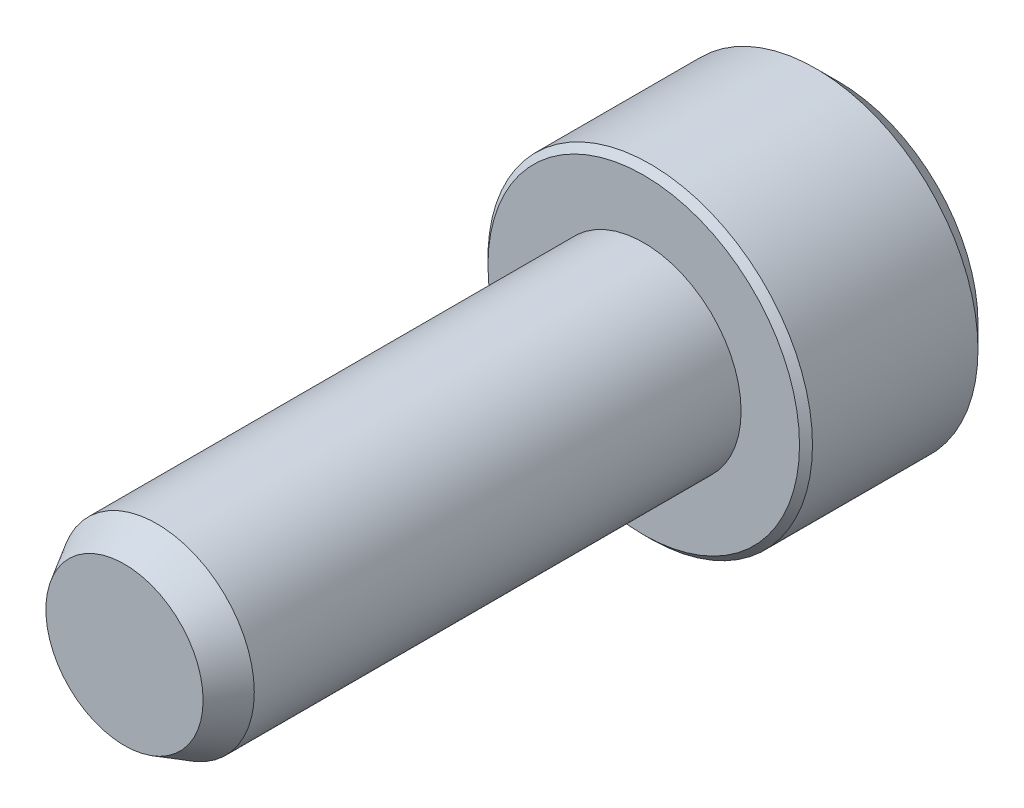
ISO-10303-21;
HEADER;
FILE_DESCRIPTION(('STEP AP214'),'2;1');
FILE_NAME('part.step','',(''),(''),'','','');
FILE_SCHEMA(('AUTOMOTIVE_DESIGN { 1 0 10303 214 1 1 1 1 }'));
ENDSEC;
DATA;
#1=APPLICATION_CONTEXT('core data for automotive mechanical design processes');
#2=APPLICATION_PROTOCOL_DEFINITION('international standard','automotive_design',2000,#1);
#3=PRODUCT_CONTEXT('',#1,'mechanical');
#4=PRODUCT('Part','Part','',(#3));
#5=PRODUCT_RELATED_PRODUCT_CATEGORY('part','',(#4));
#6=PRODUCT_DEFINITION_FORMATION('','',#4);
#7=PRODUCT_DEFINITION_CONTEXT('part definition',#1,'design');
#8=PRODUCT_DEFINITION('design','',#6,#7);
#9=PRODUCT_DEFINITION_SHAPE('','',#8);
#10=(LENGTH_UNIT() NAMED_UNIT(*) SI_UNIT(.MILLI.,.METRE.));
#11=(NAMED_UNIT(*) PLANE_ANGLE_UNIT() SI_UNIT($,.RADIAN.));
#12=(NAMED_UNIT(*) SI_UNIT($,.STERADIAN.) SOLID_ANGLE_UNIT());
#13=UNCERTAINTY_MEASURE_WITH_UNIT(LENGTH_MEASURE(1.E-05),#10,'distance_accuracy_value','');
#14=(GEOMETRIC_REPRESENTATION_CONTEXT(3) GLOBAL_UNCERTAINTY_ASSIGNED_CONTEXT((#13)) GLOBAL_UNIT_ASSIGNED_CONTEXT((#10,
#11,#12)) REPRESENTATION_CONTEXT('',''));
#15=CARTESIAN_POINT('',(0.,0.,0.));
#16=DIRECTION('',(0.,0.,1.));
#17=DIRECTION('',(1.,0.,0.));
#18=AXIS2_PLACEMENT_3D('',#15,#16,#17);
#19=CARTESIAN_POINT('',(0.,0.,-6.));
#20=DIRECTION('',(0.,0.,1.));
#21=DIRECTION('',(1.,0.,0.));
#22=AXIS2_PLACEMENT_3D('',#19,#20,#21);
#23=PLANE('',#22);
#24=CARTESIAN_POINT('',(0.,0.,-6.));
#25=DIRECTION('',(0.,0.,1.));
#26=DIRECTION('',(1.,0.,0.));
#27=AXIS2_PLACEMENT_3D('',#24,#25,#26);
#28=CIRCLE('',#27,4.3);
#29=CARTESIAN_POINT('',(4.3,0.,-6.));
#30=VERTEX_POINT('',#29);
#31=EDGE_CURVE('E140',#30,#30,#28,.F.);
#32=ORIENTED_EDGE('',*,*,#31,.T.);
#33=EDGE_LOOP('',(#32));
#34=FACE_BOUND('',#33,.T.);
#35=DIRECTION('',(-0.500000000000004,-0.866025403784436,0.));
#36=VECTOR('',#35,1.);
#37=CARTESIAN_POINT('',(-1.44337567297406,2.5,-6.));
#38=LINE('',#37,#36);
#39=CARTESIAN_POINT('',(-1.44337567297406,2.5,-6.));
#40=VERTEX_POINT('',#39);
#41=CARTESIAN_POINT('',(-2.88675134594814,0.,-6.));
#42=VERTEX_POINT('',#41);
#43=EDGE_CURVE('E47',#40,#42,#38,.T.);
#44=ORIENTED_EDGE('',*,*,#43,.T.);
#45=DIRECTION('',(0.500000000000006,-0.866025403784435,0.));
#46=VECTOR('',#45,1.);
#47=CARTESIAN_POINT('',(-2.88675134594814,0.,-6.));
#48=LINE('',#47,#46);
#49=CARTESIAN_POINT('',(-1.44337567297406,-2.5,-6.));
#50=VERTEX_POINT('',#49);
#51=EDGE_CURVE('E87',#42,#50,#48,.T.);
#52=ORIENTED_EDGE('',*,*,#51,.T.);
#53=DIRECTION('',(1.,0.,0.));
#54=VECTOR('',#53,1.);
#55=CARTESIAN_POINT('',(-1.44337567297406,-2.5,-6.));
#56=LINE('',#55,#54);
#57=CARTESIAN_POINT('',(1.44337567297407,-2.5,-6.));
#58=VERTEX_POINT('',#57);
#59=EDGE_CURVE('E95',#50,#58,#56,.T.);
#60=ORIENTED_EDGE('',*,*,#59,.T.);
#61=DIRECTION('',(0.500000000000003,0.866025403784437,0.));
#62=VECTOR('',#61,1.);
#63=CARTESIAN_POINT('',(1.44337567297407,-2.5,-6.));
#64=LINE('',#63,#62);
#65=CARTESIAN_POINT('',(2.88675134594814,0.,-6.));
#66=VERTEX_POINT('',#65);
#67=EDGE_CURVE('E110',#58,#66,#64,.T.);
#68=ORIENTED_EDGE('',*,*,#67,.T.);
#69=DIRECTION('',(-0.499999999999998,0.86602540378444,0.));
#70=VECTOR('',#69,1.);
#71=CARTESIAN_POINT('',(1.44337567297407,2.5,-6.));
#72=LINE('',#71,#70);
#73=CARTESIAN_POINT('',(1.44337567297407,2.5,-6.));
#74=VERTEX_POINT('',#73);
#75=EDGE_CURVE('E113',#66,#74,#72,.T.);
#76=ORIENTED_EDGE('',*,*,#75,.T.);
#77=DIRECTION('',(-1.,0.,0.));
#78=VECTOR('',#77,1.);
#79=CARTESIAN_POINT('',(-1.44337567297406,2.5,-6.));
#80=LINE('',#79,#78);
#81=EDGE_CURVE('E106',#74,#40,#80,.T.);
#82=ORIENTED_EDGE('',*,*,#81,.T.);
#83=EDGE_LOOP('',(#44,#52,#60,#68,#76,#82));
#84=FACE_BOUND('',#83,.T.);
#85=ADVANCED_FACE('F32',(#34,#84),#23,.F.);
#86=CARTESIAN_POINT('',(0.,0.,16.));
#87=DIRECTION('',(0.,0.,-1.));
#88=DIRECTION('',(-1.,0.,0.));
#89=AXIS2_PLACEMENT_3D('',#86,#87,#88);
#90=CYLINDRICAL_SURFACE('',#89,3.);
#91=CARTESIAN_POINT('',(0.,0.,15.));
#92=DIRECTION('',(0.,0.,1.));
#93=DIRECTION('',(1.,0.,0.));
#94=AXIS2_PLACEMENT_3D('',#91,#92,#93);
#95=CIRCLE('',#94,3.);
#96=CARTESIAN_POINT('',(3.,0.,15.));
#97=VERTEX_POINT('',#96);
#98=EDGE_CURVE('E146',#97,#97,#95,.F.);
#99=ORIENTED_EDGE('',*,*,#98,.T.);
#100=EDGE_LOOP('',(#99));
#101=FACE_BOUND('',#100,.T.);
#102=CARTESIAN_POINT('',(0.,0.,0.));
#103=DIRECTION('',(0.,0.,1.));
#104=DIRECTION('',(1.,0.,0.));
#105=AXIS2_PLACEMENT_3D('',#102,#103,#104);
#106=CIRCLE('',#105,3.);
#107=CARTESIAN_POINT('',(3.,0.,0.));
#108=VERTEX_POINT('',#107);
#109=EDGE_CURVE('E101',#108,#108,#106,.T.);
#110=ORIENTED_EDGE('',*,*,#109,.T.);
#111=EDGE_LOOP('',(#110));
#112=FACE_BOUND('',#111,.T.);
#113=ADVANCED_FACE('F34',(#101,#112),#90,.T.);
#114=CARTESIAN_POINT('',(0.,0.,16.));
#115=DIRECTION('',(0.,0.,1.));
#116=DIRECTION('',(1.,0.,0.));
#117=AXIS2_PLACEMENT_3D('',#114,#115,#116);
#118=PLANE('',#117);
#119=CARTESIAN_POINT('',(0.,0.,16.));
#120=DIRECTION('',(0.,0.,1.));
#121=DIRECTION('',(1.,0.,0.));
#122=AXIS2_PLACEMENT_3D('',#119,#120,#121);
#123=CIRCLE('',#122,2.42264973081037);
#124=CARTESIAN_POINT('',(2.42264973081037,0.,16.));
#125=VERTEX_POINT('',#124);
#126=EDGE_CURVE('E143',#125,#125,#123,.T.);
#127=ORIENTED_EDGE('',*,*,#126,.T.);
#128=EDGE_LOOP('',(#127));
#129=FACE_BOUND('',#128,.T.);
#130=ADVANCED_FACE('F172',(#129),#118,.T.);
#131=CARTESIAN_POINT('',(0.,0.,0.));
#132=DIRECTION('',(0.,0.,1.));
#133=DIRECTION('',(1.,0.,0.));
#134=AXIS2_PLACEMENT_3D('',#131,#132,#133);
#135=PLANE('',#134);
#136=CARTESIAN_POINT('',(0.,0.,0.));
#137=DIRECTION('',(0.,0.,1.));
#138=DIRECTION('',(1.,0.,0.));
#139=AXIS2_PLACEMENT_3D('',#136,#137,#138);
#140=CIRCLE('',#139,4.8);
#141=CARTESIAN_POINT('',(4.8,0.,0.));
#142=VERTEX_POINT('',#141);
#143=EDGE_CURVE('E40',#142,#142,#140,.T.);
#144=ORIENTED_EDGE('',*,*,#143,.T.);
#145=EDGE_LOOP('',(#144));
#146=FACE_BOUND('',#145,.T.);
#147=ORIENTED_EDGE('',*,*,#109,.F.);
#148=EDGE_LOOP('',(#147));
#149=FACE_BOUND('',#148,.T.);
#150=ADVANCED_FACE('F151',(#146,#149),#135,.T.);
#151=CARTESIAN_POINT('',(0.,0.,-6.));
#152=DIRECTION('',(0.,0.,1.));
#153=DIRECTION('',(1.,0.,0.));
#154=AXIS2_PLACEMENT_3D('',#151,#152,#153);
#155=CYLINDRICAL_SURFACE('',#154,5.);
#156=CARTESIAN_POINT('',(0.,0.,-0.200000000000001));
#157=DIRECTION('',(0.,0.,1.));
#158=DIRECTION('',(1.,0.,0.));
#159=AXIS2_PLACEMENT_3D('',#156,#157,#158);
#160=CIRCLE('',#159,5.);
#161=CARTESIAN_POINT('',(5.,0.,-0.200000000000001));
#162=VERTEX_POINT('',#161);
#163=EDGE_CURVE('E11',#162,#162,#160,.F.);
#164=ORIENTED_EDGE('',*,*,#163,.T.);
#165=EDGE_LOOP('',(#164));
#166=FACE_BOUND('',#165,.T.);
#167=CARTESIAN_POINT('',(0.,0.,-5.3));
#168=DIRECTION('',(0.,0.,1.));
#169=DIRECTION('',(1.,0.,0.));
#170=AXIS2_PLACEMENT_3D('',#167,#168,#169);
#171=CIRCLE('',#170,5.);
#172=CARTESIAN_POINT('',(5.,0.,-5.3));
#173=VERTEX_POINT('',#172);
#174=EDGE_CURVE('E137',#173,#173,#171,.T.);
#175=ORIENTED_EDGE('',*,*,#174,.T.);
#176=EDGE_LOOP('',(#175));
#177=FACE_BOUND('',#176,.T.);
#178=ADVANCED_FACE('F177',(#166,#177),#155,.T.);
#179=CARTESIAN_POINT('',(-1.44337567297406,2.5,-3.));
#180=DIRECTION('',(0.866025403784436,-0.500000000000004,0.));
#181=DIRECTION('',(0.500000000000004,0.866025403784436,0.));
#182=AXIS2_PLACEMENT_3D('',#179,#180,#181);
#183=PLANE('',#182);
#184=ORIENTED_EDGE('',*,*,#43,.F.);
#185=DIRECTION('',(0.,0.,-1.));
#186=VECTOR('',#185,1.);
#187=CARTESIAN_POINT('',(-1.44337567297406,2.5,-3.));
#188=LINE('',#187,#186);
#189=CARTESIAN_POINT('',(-1.44337567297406,2.5,-3.));
#190=VERTEX_POINT('',#189);
#191=EDGE_CURVE('E126',#190,#40,#188,.T.);
#192=ORIENTED_EDGE('',*,*,#191,.F.);
#193=DIRECTION('',(-0.500000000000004,-0.866025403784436,0.));
#194=VECTOR('',#193,1.);
#195=CARTESIAN_POINT('',(-1.44337567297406,2.5,-3.));
#196=LINE('',#195,#194);
#197=CARTESIAN_POINT('',(-2.88675134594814,0.,-3.));
#198=VERTEX_POINT('',#197);
#199=EDGE_CURVE('E100',#190,#198,#196,.T.);
#200=ORIENTED_EDGE('',*,*,#199,.T.);
#201=DIRECTION('',(0.,0.,-1.));
#202=VECTOR('',#201,1.);
#203=CARTESIAN_POINT('',(-2.88675134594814,0.,-3.));
#204=LINE('',#203,#202);
#205=EDGE_CURVE('E89',#198,#42,#204,.T.);
#206=ORIENTED_EDGE('',*,*,#205,.T.);
#207=EDGE_LOOP('',(#184,#192,#200,#206));
#208=FACE_BOUND('',#207,.T.);
#209=ADVANCED_FACE('F98',(#208),#183,.T.);
#210=CARTESIAN_POINT('',(-2.88675134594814,0.,-3.));
#211=DIRECTION('',(0.866025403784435,0.500000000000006,0.));
#212=DIRECTION('',(-0.500000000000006,0.866025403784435,0.));
#213=AXIS2_PLACEMENT_3D('',#210,#211,#212);
#214=PLANE('',#213);
#215=ORIENTED_EDGE('',*,*,#51,.F.);
#216=ORIENTED_EDGE('',*,*,#205,.F.);
#217=DIRECTION('',(0.500000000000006,-0.866025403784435,0.));
#218=VECTOR('',#217,1.);
#219=CARTESIAN_POINT('',(-2.88675134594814,0.,-3.));
#220=LINE('',#219,#218);
#221=CARTESIAN_POINT('',(-1.44337567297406,-2.5,-3.));
#222=VERTEX_POINT('',#221);
#223=EDGE_CURVE('E117',#198,#222,#220,.T.);
#224=ORIENTED_EDGE('',*,*,#223,.T.);
#225=DIRECTION('',(0.,0.,-1.));
#226=VECTOR('',#225,1.);
#227=CARTESIAN_POINT('',(-1.44337567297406,-2.5,-3.));
#228=LINE('',#227,#226);
#229=EDGE_CURVE('E91',#222,#50,#228,.T.);
#230=ORIENTED_EDGE('',*,*,#229,.T.);
#231=EDGE_LOOP('',(#215,#216,#224,#230));
#232=FACE_BOUND('',#231,.T.);
#233=ADVANCED_FACE('F88',(#232),#214,.T.);
#234=CARTESIAN_POINT('',(-1.44337567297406,-2.5,-3.));
#235=DIRECTION('',(0.,1.,0.));
#236=DIRECTION('',(0.,0.,1.));
#237=AXIS2_PLACEMENT_3D('',#234,#235,#236);
#238=PLANE('',#237);
#239=ORIENTED_EDGE('',*,*,#59,.F.);
#240=ORIENTED_EDGE('',*,*,#229,.F.);
#241=DIRECTION('',(1.,0.,0.));
#242=VECTOR('',#241,1.);
#243=CARTESIAN_POINT('',(-1.44337567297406,-2.5,-3.));
#244=LINE('',#243,#242);
#245=CARTESIAN_POINT('',(1.44337567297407,-2.5,-3.));
#246=VERTEX_POINT('',#245);
#247=EDGE_CURVE('E119',#222,#246,#244,.T.);
#248=ORIENTED_EDGE('',*,*,#247,.T.);
#249=DIRECTION('',(0.,0.,-1.));
#250=VECTOR('',#249,1.);
#251=CARTESIAN_POINT('',(1.44337567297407,-2.5,-3.));
#252=LINE('',#251,#250);
#253=EDGE_CURVE('E132',#246,#58,#252,.T.);
#254=ORIENTED_EDGE('',*,*,#253,.T.);
#255=EDGE_LOOP('',(#239,#240,#248,#254));
#256=FACE_BOUND('',#255,.T.);
#257=ADVANCED_FACE('F205',(#256),#238,.T.);
#258=CARTESIAN_POINT('',(1.44337567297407,-2.5,-3.));
#259=DIRECTION('',(-0.866025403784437,0.500000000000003,0.));
#260=DIRECTION('',(-0.500000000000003,-0.866025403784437,0.));
#261=AXIS2_PLACEMENT_3D('',#258,#259,#260);
#262=PLANE('',#261);
#263=ORIENTED_EDGE('',*,*,#67,.F.);
#264=ORIENTED_EDGE('',*,*,#253,.F.);
#265=DIRECTION('',(0.500000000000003,0.866025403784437,0.));
#266=VECTOR('',#265,1.);
#267=CARTESIAN_POINT('',(1.44337567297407,-2.5,-3.));
#268=LINE('',#267,#266);
#269=CARTESIAN_POINT('',(2.88675134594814,0.,-3.));
#270=VERTEX_POINT('',#269);
#271=EDGE_CURVE('E121',#246,#270,#268,.T.);
#272=ORIENTED_EDGE('',*,*,#271,.T.);
#273=DIRECTION('',(0.,0.,-1.));
#274=VECTOR('',#273,1.);
#275=CARTESIAN_POINT('',(2.88675134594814,0.,-3.));
#276=LINE('',#275,#274);
#277=EDGE_CURVE('E130',#270,#66,#276,.T.);
#278=ORIENTED_EDGE('',*,*,#277,.T.);
#279=EDGE_LOOP('',(#263,#264,#272,#278));
#280=FACE_BOUND('',#279,.T.);
#281=ADVANCED_FACE('F212',(#280),#262,.T.);
#282=CARTESIAN_POINT('',(1.44337567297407,2.5,-3.));
#283=DIRECTION('',(-0.86602540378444,-0.499999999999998,0.));
#284=DIRECTION('',(0.499999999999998,-0.86602540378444,0.));
#285=AXIS2_PLACEMENT_3D('',#282,#283,#284);
#286=PLANE('',#285);
#287=ORIENTED_EDGE('',*,*,#75,.F.);
#288=ORIENTED_EDGE('',*,*,#277,.F.);
#289=DIRECTION('',(-0.499999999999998,0.86602540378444,0.));
#290=VECTOR('',#289,1.);
#291=CARTESIAN_POINT('',(1.44337567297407,2.5,-3.));
#292=LINE('',#291,#290);
#293=CARTESIAN_POINT('',(1.44337567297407,2.5,-3.));
#294=VERTEX_POINT('',#293);
#295=EDGE_CURVE('E123',#270,#294,#292,.T.);
#296=ORIENTED_EDGE('',*,*,#295,.T.);
#297=DIRECTION('',(0.,0.,-1.));
#298=VECTOR('',#297,1.);
#299=CARTESIAN_POINT('',(1.44337567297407,2.5,-3.));
#300=LINE('',#299,#298);
#301=EDGE_CURVE('E128',#294,#74,#300,.T.);
#302=ORIENTED_EDGE('',*,*,#301,.T.);
#303=EDGE_LOOP('',(#287,#288,#296,#302));
#304=FACE_BOUND('',#303,.T.);
#305=ADVANCED_FACE('F220',(#304),#286,.T.);
#306=CARTESIAN_POINT('',(-1.44337567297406,2.5,-3.));
#307=DIRECTION('',(0.,-1.,0.));
#308=DIRECTION('',(0.,0.,-1.));
#309=AXIS2_PLACEMENT_3D('',#306,#307,#308);
#310=PLANE('',#309);
#311=ORIENTED_EDGE('',*,*,#81,.F.);
#312=ORIENTED_EDGE('',*,*,#301,.F.);
#313=DIRECTION('',(-1.,0.,0.));
#314=VECTOR('',#313,1.);
#315=CARTESIAN_POINT('',(-1.44337567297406,2.5,-3.));
#316=LINE('',#315,#314);
#317=EDGE_CURVE('E54',#294,#190,#316,.T.);
#318=ORIENTED_EDGE('',*,*,#317,.T.);
#319=ORIENTED_EDGE('',*,*,#191,.T.);
#320=EDGE_LOOP('',(#311,#312,#318,#319));
#321=FACE_BOUND('',#320,.T.);
#322=ADVANCED_FACE('F228',(#321),#310,.T.);
#323=CARTESIAN_POINT('',(-2.88675134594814,0.,-3.));
#324=DIRECTION('',(0.,0.,1.));
#325=DIRECTION('',(1.,0.,0.));
#326=AXIS2_PLACEMENT_3D('',#323,#324,#325);
#327=PLANE('',#326);
#328=ORIENTED_EDGE('',*,*,#199,.F.);
#329=ORIENTED_EDGE('',*,*,#317,.F.);
#330=ORIENTED_EDGE('',*,*,#295,.F.);
#331=ORIENTED_EDGE('',*,*,#271,.F.);
#332=ORIENTED_EDGE('',*,*,#247,.F.);
#333=ORIENTED_EDGE('',*,*,#223,.F.);
#334=EDGE_LOOP('',(#328,#329,#330,#331,#332,#333));
#335=FACE_BOUND('',#334,.T.);
#336=ADVANCED_FACE('F236',(#335),#327,.F.);
#337=CARTESIAN_POINT('',(0.,0.,-5.3));
#338=DIRECTION('',(0.,0.,1.));
#339=DIRECTION('',(1.,0.,0.));
#340=AXIS2_PLACEMENT_3D('',#337,#338,#339);
#341=CONICAL_SURFACE('',#340,5.,0.78539816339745);
#342=ORIENTED_EDGE('',*,*,#31,.F.);
#343=EDGE_LOOP('',(#342));
#344=FACE_BOUND('',#343,.T.);
#345=ORIENTED_EDGE('',*,*,#174,.F.);
#346=EDGE_LOOP('',(#345));
#347=FACE_BOUND('',#346,.T.);
#348=ADVANCED_FACE('F162',(#344,#347),#341,.T.);
#349=CARTESIAN_POINT('',(0.,0.,16.));
#350=DIRECTION('',(0.,0.,-1.));
#351=DIRECTION('',(-1.,0.,0.));
#352=AXIS2_PLACEMENT_3D('',#349,#350,#351);
#353=CONICAL_SURFACE('',#352,2.42264973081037,0.523598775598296);
#354=ORIENTED_EDGE('',*,*,#98,.F.);
#355=EDGE_LOOP('',(#354));
#356=FACE_BOUND('',#355,.T.);
#357=ORIENTED_EDGE('',*,*,#126,.F.);
#358=EDGE_LOOP('',(#357));
#359=FACE_BOUND('',#358,.T.);
#360=ADVANCED_FACE('F156',(#356,#359),#353,.T.);
#361=CARTESIAN_POINT('',(0.,0.,0.));
#362=DIRECTION('',(0.,0.,-1.));
#363=DIRECTION('',(-1.,0.,0.));
#364=AXIS2_PLACEMENT_3D('',#361,#362,#363);
#365=CONICAL_SURFACE('',#364,4.8,0.785398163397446);
#366=ORIENTED_EDGE('',*,*,#163,.F.);
#367=EDGE_LOOP('',(#366));
#368=FACE_BOUND('',#367,.T.);
#369=ORIENTED_EDGE('',*,*,#143,.F.);
#370=EDGE_LOOP('',(#369));
#371=FACE_BOUND('',#370,.T.);
#372=ADVANCED_FACE('F154',(#368,#371),#365,.T.);
#373=CLOSED_SHELL('',(#85,#113,#130,#150,#178,#209,#233,#257,#281,#305,#322,#336,#348,#360,#372));
#374=MANIFOLD_SOLID_BREP('B2',#373);
#375=ADVANCED_BREP_SHAPE_REPRESENTATION('',(#18,#374),#14);
#376=SHAPE_DEFINITION_REPRESENTATION(#9,#375);
ENDSEC;
END-ISO-10303-21;
